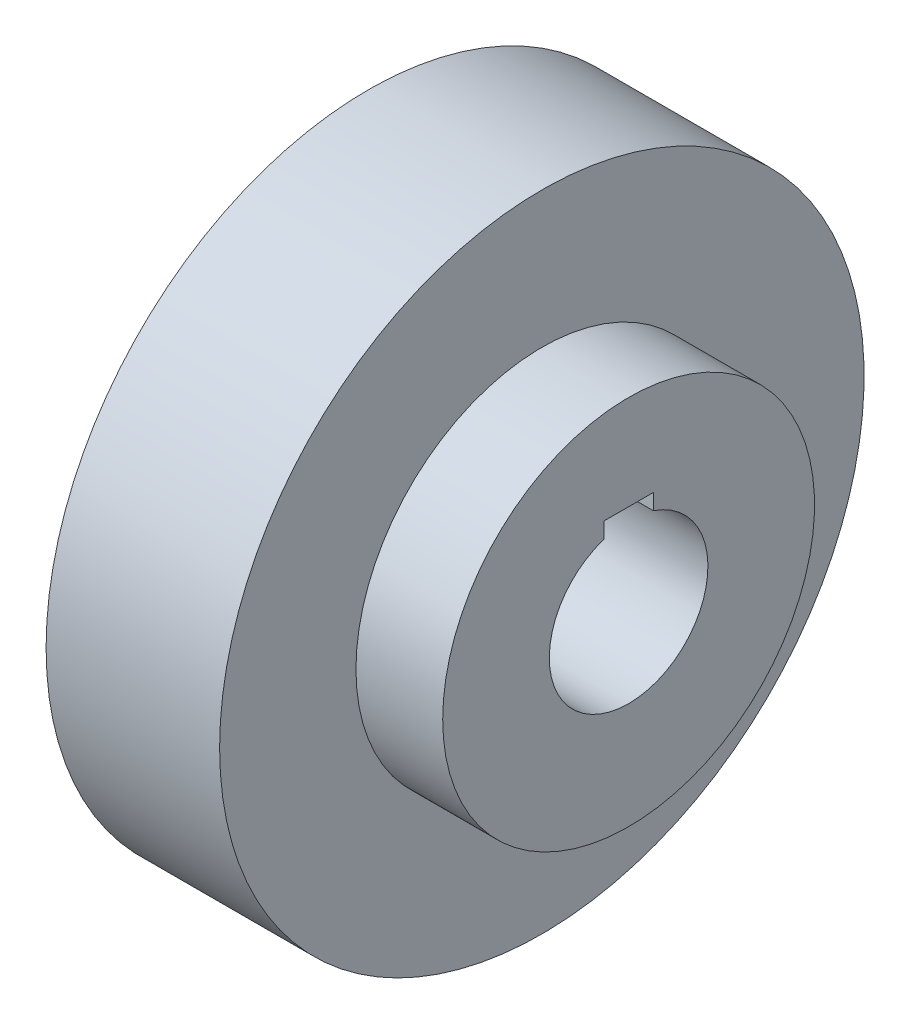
from build123d import *

# Parameters (mm, degrees)
ESQUISSE2_W             = 10
ESQUISSE2_H             = 4.934775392
ENL_V_MAT_EXTRU_1_DEPTH = 39


with BuildPart() as part:
    # Esquisse1 → Base-R_volution (revolve)
    with BuildSketch(Plane.XY, mode=Mode.PRIVATE) as base_r_volution_sk:
        Polygon((-35, 37.5), (-17.5, 37.5), (-17.5, 65), (17.5, 65), (17.5, 37.5), (35, 37.5), (35, 16), (-35, 16), align=None)
    revolve(base_r_volution_sk.sketch.rotate(Axis((-48.784126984, 0, 0), (1, 0, 0)), 90), axis=Axis((-48.784126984, 0, 0), (1, 0, 0)))

    # Esquisse2 → Enl_v. mat.-Extru.1 (cut, symmetric)
    with BuildSketch(Plane(origin=(0, 0, 0), x_dir=(0, 0, -1), z_dir=(1, 0, 0))):
        with Locations((0, 15.932612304)):
            Rectangle(ESQUISSE2_W, ESQUISSE2_H)
    extrude(amount=ENL_V_MAT_EXTRU_1_DEPTH, both=True, mode=Mode.SUBTRACT)


solid = part.part
